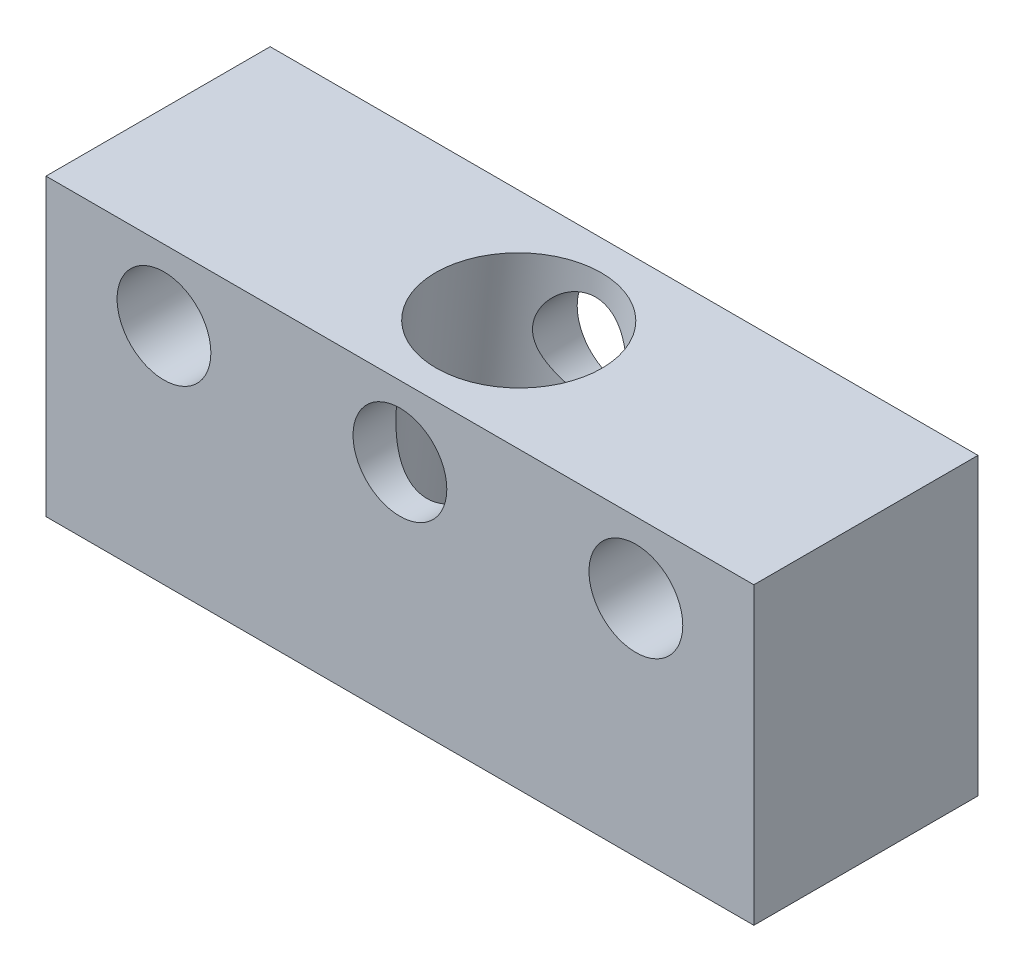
ISO-10303-21;
HEADER;
FILE_DESCRIPTION(('STEP AP214'),'2;1');
FILE_NAME('part.step','',(''),(''),'','','');
FILE_SCHEMA(('AUTOMOTIVE_DESIGN { 1 0 10303 214 1 1 1 1 }'));
ENDSEC;
DATA;
#1=APPLICATION_CONTEXT('core data for automotive mechanical design processes');
#2=APPLICATION_PROTOCOL_DEFINITION('international standard','automotive_design',2000,#1);
#3=PRODUCT_CONTEXT('',#1,'mechanical');
#4=PRODUCT('Part','Part','',(#3));
#5=PRODUCT_RELATED_PRODUCT_CATEGORY('part','',(#4));
#6=PRODUCT_DEFINITION_FORMATION('','',#4);
#7=PRODUCT_DEFINITION_CONTEXT('part definition',#1,'design');
#8=PRODUCT_DEFINITION('design','',#6,#7);
#9=PRODUCT_DEFINITION_SHAPE('','',#8);
#10=(LENGTH_UNIT() NAMED_UNIT(*) SI_UNIT(.MILLI.,.METRE.));
#11=(NAMED_UNIT(*) PLANE_ANGLE_UNIT() SI_UNIT($,.RADIAN.));
#12=(NAMED_UNIT(*) SI_UNIT($,.STERADIAN.) SOLID_ANGLE_UNIT());
#13=UNCERTAINTY_MEASURE_WITH_UNIT(LENGTH_MEASURE(1.E-05),#10,'distance_accuracy_value','');
#14=(GEOMETRIC_REPRESENTATION_CONTEXT(3) GLOBAL_UNCERTAINTY_ASSIGNED_CONTEXT((#13)) GLOBAL_UNIT_ASSIGNED_CONTEXT((#10,
#11,#12)) REPRESENTATION_CONTEXT('',''));
#15=CARTESIAN_POINT('',(0.,0.,0.));
#16=DIRECTION('',(0.,0.,1.));
#17=DIRECTION('',(1.,0.,0.));
#18=AXIS2_PLACEMENT_3D('',#15,#16,#17);
#19=CARTESIAN_POINT('',(30.,-19.,19.));
#20=DIRECTION('',(0.,-1.,0.));
#21=DIRECTION('',(0.,0.,-1.));
#22=AXIS2_PLACEMENT_3D('',#19,#20,#21);
#23=PLANE('',#22);
#24=DIRECTION('',(0.,0.,-1.));
#25=VECTOR('',#24,1.);
#26=CARTESIAN_POINT('',(30.,-19.,19.));
#27=LINE('',#26,#25);
#28=CARTESIAN_POINT('',(30.,-19.,19.));
#29=VERTEX_POINT('',#28);
#30=CARTESIAN_POINT('',(30.,-19.,0.));
#31=VERTEX_POINT('',#30);
#32=EDGE_CURVE('E49',#29,#31,#27,.T.);
#33=ORIENTED_EDGE('',*,*,#32,.F.);
#34=DIRECTION('',(-1.,0.,0.));
#35=VECTOR('',#34,1.);
#36=CARTESIAN_POINT('',(30.,-19.,19.));
#37=LINE('',#36,#35);
#38=CARTESIAN_POINT('',(-30.,-19.,19.));
#39=VERTEX_POINT('',#38);
#40=EDGE_CURVE('E90',#29,#39,#37,.T.);
#41=ORIENTED_EDGE('',*,*,#40,.T.);
#42=DIRECTION('',(0.,0.,-1.));
#43=VECTOR('',#42,1.);
#44=CARTESIAN_POINT('',(-30.,-19.,19.));
#45=LINE('',#44,#43);
#46=CARTESIAN_POINT('',(-30.,-19.,0.));
#47=VERTEX_POINT('',#46);
#48=EDGE_CURVE('E11',#39,#47,#45,.T.);
#49=ORIENTED_EDGE('',*,*,#48,.T.);
#50=DIRECTION('',(-1.,0.,0.));
#51=VECTOR('',#50,1.);
#52=CARTESIAN_POINT('',(30.,-19.,0.));
#53=LINE('',#52,#51);
#54=EDGE_CURVE('E87',#31,#47,#53,.T.);
#55=ORIENTED_EDGE('',*,*,#54,.F.);
#56=EDGE_LOOP('',(#33,#41,#49,#55));
#57=FACE_BOUND('',#56,.T.);
#58=CARTESIAN_POINT('',(-1.99698047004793,-19.,9.5593296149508));
#59=DIRECTION('',(0.,-1.,0.));
#60=DIRECTION('',(1.,0.,0.));
#61=AXIS2_PLACEMENT_3D('',#58,#59,#60);
#62=ELLIPSE('',#61,7.03855795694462,7.);
#63=CARTESIAN_POINT('',(5.04157748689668,-19.,9.5593296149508));
#64=VERTEX_POINT('',#63);
#65=EDGE_CURVE('E196',#64,#64,#62,.F.);
#66=ORIENTED_EDGE('',*,*,#65,.T.);
#67=EDGE_LOOP('',(#66));
#68=FACE_BOUND('',#67,.T.);
#69=ADVANCED_FACE('F36',(#57,#68),#23,.T.);
#70=CARTESIAN_POINT('',(-30.,6.,19.));
#71=DIRECTION('',(0.,1.,0.));
#72=DIRECTION('',(0.,0.,1.));
#73=AXIS2_PLACEMENT_3D('',#70,#71,#72);
#74=PLANE('',#73);
#75=DIRECTION('',(1.,0.,0.));
#76=VECTOR('',#75,1.);
#77=CARTESIAN_POINT('',(-30.,6.,19.));
#78=LINE('',#77,#76);
#79=CARTESIAN_POINT('',(-30.,6.,19.));
#80=VERTEX_POINT('',#79);
#81=CARTESIAN_POINT('',(30.,6.00000000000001,19.));
#82=VERTEX_POINT('',#81);
#83=EDGE_CURVE('E114',#80,#82,#78,.T.);
#84=ORIENTED_EDGE('',*,*,#83,.T.);
#85=DIRECTION('',(0.,0.,-1.));
#86=VECTOR('',#85,1.);
#87=CARTESIAN_POINT('',(30.,6.00000000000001,19.));
#88=LINE('',#87,#86);
#89=CARTESIAN_POINT('',(30.,6.00000000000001,0.));
#90=VERTEX_POINT('',#89);
#91=EDGE_CURVE('E65',#82,#90,#88,.T.);
#92=ORIENTED_EDGE('',*,*,#91,.T.);
#93=DIRECTION('',(1.,0.,0.));
#94=VECTOR('',#93,1.);
#95=CARTESIAN_POINT('',(-30.,6.,0.));
#96=LINE('',#95,#94);
#97=CARTESIAN_POINT('',(-30.,6.,0.));
#98=VERTEX_POINT('',#97);
#99=EDGE_CURVE('E104',#98,#90,#96,.T.);
#100=ORIENTED_EDGE('',*,*,#99,.F.);
#101=DIRECTION('',(0.,0.,-1.));
#102=VECTOR('',#101,1.);
#103=CARTESIAN_POINT('',(-30.,6.,19.));
#104=LINE('',#103,#102);
#105=EDGE_CURVE('E57',#80,#98,#104,.T.);
#106=ORIENTED_EDGE('',*,*,#105,.F.);
#107=EDGE_LOOP('',(#84,#92,#100,#106));
#108=FACE_BOUND('',#107,.T.);
#109=CARTESIAN_POINT('',(0.630625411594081,6.00000000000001,9.5593296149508));
#110=DIRECTION('',(0.,1.,0.));
#111=DIRECTION('',(1.,0.,0.));
#112=AXIS2_PLACEMENT_3D('',#109,#110,#111);
#113=ELLIPSE('',#112,7.03855795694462,7.);
#114=CARTESIAN_POINT('',(7.6691833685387,6.00000000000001,9.5593296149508));
#115=VERTEX_POINT('',#114);
#116=EDGE_CURVE('E198',#115,#115,#113,.F.);
#117=ORIENTED_EDGE('',*,*,#116,.T.);
#118=EDGE_LOOP('',(#117));
#119=FACE_BOUND('',#118,.T.);
#120=ADVANCED_FACE('F144',(#108,#119),#74,.T.);
#121=CARTESIAN_POINT('',(0.,0.,19.));
#122=DIRECTION('',(0.,0.,-1.));
#123=DIRECTION('',(-1.,0.,0.));
#124=AXIS2_PLACEMENT_3D('',#121,#122,#123);
#125=CYLINDRICAL_SURFACE('',#124,3.975);
#126=CARTESIAN_POINT('',(0.,0.,19.));
#127=DIRECTION('',(0.,0.,1.));
#128=DIRECTION('',(1.,0.,0.));
#129=AXIS2_PLACEMENT_3D('',#126,#127,#128);
#130=CIRCLE('',#129,3.975);
#131=CARTESIAN_POINT('',(3.975,0.,19.));
#132=VERTEX_POINT('',#131);
#133=EDGE_CURVE('E175',#132,#132,#130,.T.);
#134=ORIENTED_EDGE('',*,*,#133,.T.);
#135=EDGE_LOOP('',(#134));
#136=FACE_BOUND('',#135,.T.);
#137=CARTESIAN_POINT('',(-3.975,0.,15.3361813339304));
#138=CARTESIAN_POINT('',(-3.97500047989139,0.0970481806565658,15.3292387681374));
#139=CARTESIAN_POINT('',(-3.97144172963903,0.194261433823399,15.324672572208));
#140=CARTESIAN_POINT('',(-3.9571848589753,0.388302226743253,15.3204647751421));
#141=CARTESIAN_POINT('',(-3.94648471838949,0.485129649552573,15.3208245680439));
#142=CARTESIAN_POINT('',(-3.91803147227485,0.677576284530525,15.3264615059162));
#143=CARTESIAN_POINT('',(-3.9002800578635,0.773195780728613,15.3317374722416));
#144=CARTESIAN_POINT('',(-3.85792428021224,0.962536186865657,15.346991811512));
#145=CARTESIAN_POINT('',(-3.83331709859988,1.05625629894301,15.3569721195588));
#146=CARTESIAN_POINT('',(-3.74985033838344,1.3327026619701,15.3933485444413));
#147=CARTESIAN_POINT('',(-3.68119154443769,1.51173557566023,15.4262161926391));
#148=CARTESIAN_POINT('',(-3.52041410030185,1.85566346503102,15.5050484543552));
#149=CARTESIAN_POINT('',(-3.4282811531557,2.02054974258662,15.5510210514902));
#150=CARTESIAN_POINT('',(-3.21549166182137,2.34556654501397,15.6549592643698));
#151=CARTESIAN_POINT('',(-3.09322683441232,2.50443819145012,15.7135613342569));
#152=CARTESIAN_POINT('',(-2.82719328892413,2.80132524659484,15.8346201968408));
#153=CARTESIAN_POINT('',(-2.68341173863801,2.93932811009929,15.8970792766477));
#154=CARTESIAN_POINT('',(-2.35274556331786,3.21213701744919,16.0301805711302));
#155=CARTESIAN_POINT('',(-2.162632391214,3.3432025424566,16.1006076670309));
#156=CARTESIAN_POINT('',(-1.86100008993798,3.51435873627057,16.1993437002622));
#157=CARTESIAN_POINT('',(-1.75764089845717,3.56719607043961,16.2311230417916));
#158=CARTESIAN_POINT('',(-1.54595086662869,3.66390214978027,16.2915464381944));
#159=CARTESIAN_POINT('',(-1.43762268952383,3.70777563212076,16.320192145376));
#160=CARTESIAN_POINT('',(-1.21875464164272,3.78529878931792,16.3730364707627));
#161=CARTESIAN_POINT('',(-1.10829588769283,3.81912686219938,16.3973092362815));
#162=CARTESIAN_POINT('',(-0.884056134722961,3.87717312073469,16.4413590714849));
#163=CARTESIAN_POINT('',(-0.7702769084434,3.90139633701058,16.4611384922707));
#164=CARTESIAN_POINT('',(-0.540361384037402,3.93982342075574,16.4956019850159));
#165=CARTESIAN_POINT('',(-0.424226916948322,3.95403478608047,16.5102898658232));
#166=CARTESIAN_POINT('',(-0.190596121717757,3.97215551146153,16.5341186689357));
#167=CARTESIAN_POINT('',(-0.0731000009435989,3.97606642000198,16.5432604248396));
#168=CARTESIAN_POINT('',(0.147196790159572,3.97360210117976,16.554910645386));
#169=CARTESIAN_POINT('',(0.249976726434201,3.96846518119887,16.5581117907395));
#170=CARTESIAN_POINT('',(0.454904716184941,3.95022424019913,16.5599740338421));
#171=CARTESIAN_POINT('',(0.557052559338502,3.93711769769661,16.5586336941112));
#172=CARTESIAN_POINT('',(0.759817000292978,3.90305797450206,16.5514432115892));
#173=CARTESIAN_POINT('',(0.860434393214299,3.88210902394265,16.5455954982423));
#174=CARTESIAN_POINT('',(1.05943473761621,3.83259139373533,16.5295500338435));
#175=CARTESIAN_POINT('',(1.15781682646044,3.80401982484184,16.5193506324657));
#176=CARTESIAN_POINT('',(1.43884001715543,3.71051469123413,16.4837968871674));
#177=CARTESIAN_POINT('',(1.61772233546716,3.63598247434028,16.4530612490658));
#178=CARTESIAN_POINT('',(1.96066934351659,3.46314514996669,16.3793153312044));
#179=CARTESIAN_POINT('',(2.12473153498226,3.36483604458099,16.336302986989));
#180=CARTESIAN_POINT('',(2.44760953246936,3.13873345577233,16.2375685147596));
#181=CARTESIAN_POINT('',(2.60500307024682,3.00923151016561,16.1811138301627));
#182=CARTESIAN_POINT('',(2.89722748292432,2.72905735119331,16.0623670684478));
#183=CARTESIAN_POINT('',(3.03203790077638,2.57836616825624,16.0000697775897));
#184=CARTESIAN_POINT('',(3.29239197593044,2.23876037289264,15.8669059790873));
#185=CARTESIAN_POINT('',(3.41473502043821,2.04742354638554,15.7959313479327));
#186=CARTESIAN_POINT('',(3.62585452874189,1.64481139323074,15.6607798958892));
#187=CARTESIAN_POINT('',(3.71464607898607,1.43354508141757,15.5966000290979));
#188=CARTESIAN_POINT('',(3.84407946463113,1.03009538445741,15.4926743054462));
#189=CARTESIAN_POINT('',(3.89014295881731,0.840244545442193,15.4506638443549));
#190=CARTESIAN_POINT('',(3.95394493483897,0.453117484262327,15.3826703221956));
#191=CARTESIAN_POINT('',(3.97171862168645,0.255850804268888,15.3566673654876));
#192=CARTESIAN_POINT('',(3.97746278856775,-0.141765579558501,15.3244027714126));
#193=CARTESIAN_POINT('',(3.96529178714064,-0.342125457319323,15.3182351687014));
#194=CARTESIAN_POINT('',(3.91095152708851,-0.738287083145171,15.326941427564));
#195=CARTESIAN_POINT('',(3.86877652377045,-0.934087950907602,15.3418193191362));
#196=CARTESIAN_POINT('',(3.76054059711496,-1.30113345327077,15.3884447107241));
#197=CARTESIAN_POINT('',(3.6964237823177,-1.4731304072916,15.4188968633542));
#198=CARTESIAN_POINT('',(3.54647456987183,-1.80450951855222,15.4921533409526));
#199=CARTESIAN_POINT('',(3.46063401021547,-1.96388690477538,15.5349623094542));
#200=CARTESIAN_POINT('',(3.25860174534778,-2.2852064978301,15.6340905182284));
#201=CARTESIAN_POINT('',(3.14006358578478,-2.44536352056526,15.6913942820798));
#202=CARTESIAN_POINT('',(2.88144349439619,-2.74539293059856,15.8105077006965));
#203=CARTESIAN_POINT('',(2.74134534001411,-2.88524988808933,15.872320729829));
#204=CARTESIAN_POINT('',(2.41846905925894,-3.16287065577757,16.0048544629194));
#205=CARTESIAN_POINT('',(2.23244175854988,-3.29692963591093,16.0754662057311));
#206=CARTESIAN_POINT('',(1.83769503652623,-3.5321615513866,16.2085435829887));
#207=CARTESIAN_POINT('',(1.62897337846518,-3.63333124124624,16.2710084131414));
#208=CARTESIAN_POINT('',(1.30351741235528,-3.75697457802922,16.353330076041));
#209=CARTESIAN_POINT('',(1.19334542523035,-3.79343089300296,16.378810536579));
#210=CARTESIAN_POINT('',(0.96939479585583,-3.85673608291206,16.4253972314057));
#211=CARTESIAN_POINT('',(0.855618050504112,-3.88358992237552,16.4465057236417));
#212=CARTESIAN_POINT('',(0.625434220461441,-3.92723488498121,16.4836951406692));
#213=CARTESIAN_POINT('',(0.509029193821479,-3.94403361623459,16.4997798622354));
#214=CARTESIAN_POINT('',(0.274564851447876,-3.96725454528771,16.5264291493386));
#215=CARTESIAN_POINT('',(0.15650579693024,-3.97367836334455,16.5369945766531));
#216=CARTESIAN_POINT('',(-0.065218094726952,-3.97581130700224,16.551296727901));
#217=CARTESIAN_POINT('',(-0.16882837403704,-3.97276488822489,16.5557244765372));
#218=CARTESIAN_POINT('',(-0.375624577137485,-3.9585698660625,16.5599807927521));
#219=CARTESIAN_POINT('',(-0.478810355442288,-3.9474186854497,16.5598078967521));
#220=CARTESIAN_POINT('',(-0.683829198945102,-3.91710731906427,16.5548617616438));
#221=CARTESIAN_POINT('',(-0.785663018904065,-3.89795181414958,16.5500912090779));
#222=CARTESIAN_POINT('',(-0.987248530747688,-3.85184074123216,16.5360857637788));
#223=CARTESIAN_POINT('',(-1.08699942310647,-3.82488223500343,16.5268491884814));
#224=CARTESIAN_POINT('',(-1.37054842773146,-3.73627840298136,16.49407987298));
#225=CARTESIAN_POINT('',(-1.5508301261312,-3.66501761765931,16.4651243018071));
#226=CARTESIAN_POINT('',(-1.89703898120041,-3.49841023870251,16.3945877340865));
#227=CARTESIAN_POINT('',(-2.06296369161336,-3.40305955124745,16.3530045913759));
#228=CARTESIAN_POINT('',(-2.38905080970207,-3.18346095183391,16.2570938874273));
#229=CARTESIAN_POINT('',(-2.54793474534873,-3.05762498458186,16.2020635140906));
#230=CARTESIAN_POINT('',(-2.84367750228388,-2.78472192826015,16.0856633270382));
#231=CARTESIAN_POINT('',(-2.98051984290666,-2.63763910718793,16.0242888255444));
#232=CARTESIAN_POINT('',(-3.24589213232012,-2.3055300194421,15.8923355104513));
#233=CARTESIAN_POINT('',(-3.37127244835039,-2.11805981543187,15.8215611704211));
#234=CARTESIAN_POINT('',(-3.58935965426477,-1.72278653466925,15.6856514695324));
#235=CARTESIAN_POINT('',(-3.68205766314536,-1.51497795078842,15.6205176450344));
#236=CARTESIAN_POINT('',(-3.79222517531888,-1.19645151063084,15.5348424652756));
#237=CARTESIAN_POINT('',(-3.82366829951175,-1.09188136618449,15.5088117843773));
#238=CARTESIAN_POINT('',(-3.87799486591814,-0.87963695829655,15.4608784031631));
#239=CARTESIAN_POINT('',(-3.9008829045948,-0.771964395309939,15.4389734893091));
#240=CARTESIAN_POINT('',(-3.93769819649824,-0.554363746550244,15.4001946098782));
#241=CARTESIAN_POINT('',(-3.95163821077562,-0.444439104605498,15.3833134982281));
#242=CARTESIAN_POINT('',(-3.97028801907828,-0.223082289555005,15.3553009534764));
#243=CARTESIAN_POINT('',(-3.97499944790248,-0.111650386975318,15.3441685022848));
#244=CARTESIAN_POINT('',(-3.975,0.,15.3361813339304));
#245=B_SPLINE_CURVE_WITH_KNOTS('',3,(#137,#138,#139,#140,#141,#142,#143,#144,#145,#146,#147,
#148,#149,#150,#151,#152,#153,#154,#155,#156,#157,#158,#159,#160,#161,#162,#163,#164,#165,#166,
#167,#168,#169,#170,#171,#172,#173,#174,#175,#176,#177,#178,#179,#180,#181,#182,#183,#184,#185,
#186,#187,#188,#189,#190,#191,#192,#193,#194,#195,#196,#197,#198,#199,#200,#201,#202,#203,#204,
#205,#206,#207,#208,#209,#210,#211,#212,#213,#214,#215,#216,#217,#218,#219,#220,#221,#222,#223,
#224,#225,#226,#227,#228,#229,#230,#231,#232,#233,#234,#235,#236,#237,#238,#239,#240,#241,#242,
#243,#244),.UNSPECIFIED.,.T.,.F.,(4,2,2,2,2,2,2,2,2,2,2,2,2,2,2,2,2,2,2,2,2,2,2,2,2,2,2,2,2,2,2,
2,2,2,2,2,2,2,2,2,2,2,2,2,2,2,2,2,2,2,2,2,2,4),(0.,0.291781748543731,0.583646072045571,
0.875440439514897,1.16735493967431,1.74812667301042,2.3292529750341,2.95346298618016,
3.5780467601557,4.29847876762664,4.65915610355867,5.01964233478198,5.37328000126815,
5.72673220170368,6.07991942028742,6.4330535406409,6.74152779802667,7.05009970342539,
7.35850540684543,7.66702817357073,8.25289669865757,8.83886380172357,9.47081863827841,
10.103342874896,10.8139839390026,11.524305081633,12.1213064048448,12.7175642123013,
13.3166445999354,13.9158397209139,14.471779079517,15.0279276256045,15.6475808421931,
16.2677026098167,16.9842202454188,17.7008085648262,18.056810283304,18.4126276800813,
18.7681755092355,19.1236678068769,19.434509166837,19.7454494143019,20.056208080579,
20.3670839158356,20.952312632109,21.5376408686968,22.1651804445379,22.7931870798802,
23.4992864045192,24.2055774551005,24.5419827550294,24.8782070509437,25.2139507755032,
25.5496350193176),.UNSPECIFIED.);
#246=CARTESIAN_POINT('',(-3.975,0.,15.3361813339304));
#247=VERTEX_POINT('',#246);
#248=EDGE_CURVE('E39',#247,#247,#245,.T.);
#249=ORIENTED_EDGE('',*,*,#248,.T.);
#250=EDGE_LOOP('',(#249));
#251=FACE_BOUND('',#250,.T.);
#252=ADVANCED_FACE('F123',(#136,#251),#125,.F.);
#253=CARTESIAN_POINT('',(0.,0.,0.));
#254=DIRECTION('',(0.,0.,1.));
#255=DIRECTION('',(1.,0.,0.));
#256=AXIS2_PLACEMENT_3D('',#253,#254,#255);
#257=CIRCLE('',#256,3.975);
#258=CARTESIAN_POINT('',(3.975,0.,0.));
#259=VERTEX_POINT('',#258);
#260=EDGE_CURVE('E173',#259,#259,#257,.T.);
#261=ORIENTED_EDGE('',*,*,#260,.F.);
#262=EDGE_LOOP('',(#261));
#263=FACE_BOUND('',#262,.T.);
#264=CARTESIAN_POINT('',(-3.975,0.,3.78247789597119));
#265=CARTESIAN_POINT('',(-3.97500215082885,-0.106197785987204,3.77488497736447));
#266=CARTESIAN_POINT('',(-3.97073806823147,-0.212163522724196,3.76444206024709));
#267=CARTESIAN_POINT('',(-3.95386487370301,-0.422791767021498,3.73834076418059));
#268=CARTESIAN_POINT('',(-3.94125310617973,-0.527453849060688,3.72268072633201));
#269=CARTESIAN_POINT('',(-3.89121498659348,-0.838532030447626,3.66874817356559));
#270=CARTESIAN_POINT('',(-3.84158635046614,-1.04190493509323,3.62353416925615));
#271=CARTESIAN_POINT('',(-3.71305739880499,-1.43395008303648,3.52128720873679));
#272=CARTESIAN_POINT('',(-3.63437159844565,-1.62271809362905,3.4643421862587));
#273=CARTESIAN_POINT('',(-3.45011708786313,-1.98456898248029,3.34458208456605));
#274=CARTESIAN_POINT('',(-3.34454626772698,-2.15765062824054,3.28176654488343));
#275=CARTESIAN_POINT('',(-3.09460589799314,-2.50500828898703,3.14849785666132));
#276=CARTESIAN_POINT('',(-2.94714016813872,-2.67704945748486,3.07801193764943));
#277=CARTESIAN_POINT('',(-2.62332198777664,-2.99502699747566,2.94382839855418));
#278=CARTESIAN_POINT('',(-2.44696238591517,-3.1409568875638,2.88013246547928));
#279=CARTESIAN_POINT('',(-2.16245402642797,-3.33735729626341,2.79434862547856));
#280=CARTESIAN_POINT('',(-2.06361560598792,-3.39938711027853,2.76724410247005));
#281=CARTESIAN_POINT('',(-1.86007090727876,-3.51488683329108,2.71722743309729));
#282=CARTESIAN_POINT('',(-1.75536758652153,-3.56836100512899,2.69431319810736));
#283=CARTESIAN_POINT('',(-1.54091192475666,-3.6660734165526,2.65338288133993));
#284=CARTESIAN_POINT('',(-1.43116335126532,-3.71031841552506,2.63536321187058));
#285=CARTESIAN_POINT('',(-1.20747713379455,-3.78901998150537,2.60477565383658));
#286=CARTESIAN_POINT('',(-1.0935401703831,-3.82347813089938,2.59220688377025));
#287=CARTESIAN_POINT('',(-0.876756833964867,-3.8785113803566,2.57412247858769));
#288=CARTESIAN_POINT('',(-0.77426589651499,-3.90027144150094,2.56793043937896));
#289=CARTESIAN_POINT('',(-0.56771855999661,-3.93564444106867,2.56022482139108));
#290=CARTESIAN_POINT('',(-0.463662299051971,-3.94925809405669,2.55871083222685));
#291=CARTESIAN_POINT('',(-0.25485993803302,-3.96820524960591,2.56040455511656));
#292=CARTESIAN_POINT('',(-0.15011402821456,-3.97354094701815,2.56361101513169));
#293=CARTESIAN_POINT('',(0.0591995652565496,-3.97593919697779,2.57464712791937));
#294=CARTESIAN_POINT('',(0.163767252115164,-3.97300189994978,2.58247669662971));
#295=CARTESIAN_POINT('',(0.461617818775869,-3.95286569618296,2.6112407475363));
#296=CARTESIAN_POINT('',(0.653799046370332,-3.9255683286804,2.6376544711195));
#297=CARTESIAN_POINT('',(1.02986775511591,-3.84410129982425,2.70360134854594));
#298=CARTESIAN_POINT('',(1.21375382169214,-3.78992707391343,2.74313673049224));
#299=CARTESIAN_POINT('',(1.58088709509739,-3.65269492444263,2.83499985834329));
#300=CARTESIAN_POINT('',(1.76337407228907,-3.56804152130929,2.8879733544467));
#301=CARTESIAN_POINT('',(2.11196599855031,-3.37344530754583,3.00093124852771));
#302=CARTESIAN_POINT('',(2.27806126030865,-3.26348766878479,3.0609197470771));
#303=CARTESIAN_POINT('',(2.61108323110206,-3.00543445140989,3.19088290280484));
#304=CARTESIAN_POINT('',(2.77553082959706,-2.85429292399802,3.2611700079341));
#305=CARTESIAN_POINT('',(3.07786634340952,-2.52532057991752,3.3975952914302));
#306=CARTESIAN_POINT('',(3.21573128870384,-2.34746691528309,3.46372984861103));
#307=CARTESIAN_POINT('',(3.40192520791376,-2.05944183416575,3.55481734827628));
#308=CARTESIAN_POINT('',(3.46145416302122,-1.95779218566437,3.58429318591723));
#309=CARTESIAN_POINT('',(3.57165378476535,-1.74867413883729,3.63874027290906));
#310=CARTESIAN_POINT('',(3.62232938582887,-1.64120902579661,3.66371403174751));
#311=CARTESIAN_POINT('',(3.71410168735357,-1.42135185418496,3.70798954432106));
#312=CARTESIAN_POINT('',(3.75521455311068,-1.3089684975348,3.72730088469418));
#313=CARTESIAN_POINT('',(3.8273243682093,-1.08009062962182,3.75930806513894));
#314=CARTESIAN_POINT('',(3.85832396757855,-0.963597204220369,3.77200563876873));
#315=CARTESIAN_POINT('',(3.90583866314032,-0.745379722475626,3.78872137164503));
#316=CARTESIAN_POINT('',(3.92382633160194,-0.644051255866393,3.79375329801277));
#317=CARTESIAN_POINT('',(3.95189123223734,-0.440187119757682,3.79830379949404));
#318=CARTESIAN_POINT('',(3.96196932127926,-0.337651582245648,3.79782297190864));
#319=CARTESIAN_POINT('',(3.97412970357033,-0.132276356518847,3.7913659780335));
#320=CARTESIAN_POINT('',(3.97621179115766,-0.029436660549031,3.78538967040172));
#321=CARTESIAN_POINT('',(3.97244391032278,0.175630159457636,3.76821137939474));
#322=CARTESIAN_POINT('',(3.96659400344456,0.277857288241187,3.75700943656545));
#323=CARTESIAN_POINT('',(3.93926936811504,0.562677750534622,3.71885986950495));
#324=CARTESIAN_POINT('',(3.90901212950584,0.743782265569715,3.68649442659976));
#325=CARTESIAN_POINT('',(3.82479558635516,1.09760804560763,3.60991680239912));
#326=CARTESIAN_POINT('',(3.77082905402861,1.27032673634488,3.56570101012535));
#327=CARTESIAN_POINT('',(3.63287540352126,1.62590408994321,3.46367465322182));
#328=CARTESIAN_POINT('',(3.54598747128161,1.80734850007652,3.40485693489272));
#329=CARTESIAN_POINT('',(3.34665231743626,2.15421897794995,3.28334399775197));
#330=CARTESIAN_POINT('',(3.2341846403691,2.31963207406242,3.22064570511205));
#331=CARTESIAN_POINT('',(2.96667856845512,2.65557207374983,3.08732867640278));
#332=CARTESIAN_POINT('',(2.80779093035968,2.82317338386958,3.01692546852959));
#333=CARTESIAN_POINT('',(2.54808056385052,3.05308482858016,2.91825706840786));
#334=CARTESIAN_POINT('',(2.45788555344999,3.1261783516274,2.88650637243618));
#335=CARTESIAN_POINT('',(2.27077285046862,3.26461891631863,2.82614969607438));
#336=CARTESIAN_POINT('',(2.17385875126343,3.32997004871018,2.79754205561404));
#337=CARTESIAN_POINT('',(1.97578342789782,3.45110470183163,2.74479097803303));
#338=CARTESIAN_POINT('',(1.87474057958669,3.50704880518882,2.72057190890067));
#339=CARTESIAN_POINT('',(1.66741866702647,3.61022650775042,2.67663379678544));
#340=CARTESIAN_POINT('',(1.56114237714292,3.65746466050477,2.65691240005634));
#341=CARTESIAN_POINT('',(1.34421266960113,3.74263074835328,2.62256735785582));
#342=CARTESIAN_POINT('',(1.23356255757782,3.78056556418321,2.60793994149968));
#343=CARTESIAN_POINT('',(1.00880133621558,3.84664258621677,2.58423272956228));
#344=CARTESIAN_POINT('',(0.894690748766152,3.87478626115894,2.57515210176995));
#345=CARTESIAN_POINT('',(0.678718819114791,3.9179733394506,2.5636151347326));
#346=CARTESIAN_POINT('',(0.577133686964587,3.93422346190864,2.56046620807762));
#347=CARTESIAN_POINT('',(0.372934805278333,3.95880319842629,2.55870575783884));
#348=CARTESIAN_POINT('',(0.270320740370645,3.96713030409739,2.56009567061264));
#349=CARTESIAN_POINT('',(0.0649675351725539,3.97579622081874,2.56738135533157));
#350=CARTESIAN_POINT('',(-0.0377715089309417,3.97613929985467,2.57327471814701));
#351=CARTESIAN_POINT('',(-0.242640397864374,3.96891382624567,2.58940656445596));
#352=CARTESIAN_POINT('',(-0.344769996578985,3.96134226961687,2.59964669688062));
#353=CARTESIAN_POINT('',(-0.639031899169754,3.92808083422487,2.63531910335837));
#354=CARTESIAN_POINT('',(-0.829472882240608,3.89221892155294,2.66613087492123));
#355=CARTESIAN_POINT('',(-1.20078053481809,3.79416976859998,2.74001384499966));
#356=CARTESIAN_POINT('',(-1.38164563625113,3.7319782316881,2.78308704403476));
#357=CARTESIAN_POINT('',(-1.74440026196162,3.57764265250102,2.88194178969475));
#358=CARTESIAN_POINT('',(-1.92524877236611,3.48352550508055,2.93845700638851));
#359=CARTESIAN_POINT('',(-2.26925353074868,3.26989218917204,3.05730262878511));
#360=CARTESIAN_POINT('',(-2.43239360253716,3.15035308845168,3.11963825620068));
#361=CARTESIAN_POINT('',(-2.75750910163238,2.87194113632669,3.25284598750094));
#362=CARTESIAN_POINT('',(-2.91685693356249,2.71003487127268,3.32382233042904));
#363=CARTESIAN_POINT('',(-3.20683437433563,2.3597683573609,3.45893441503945));
#364=CARTESIAN_POINT('',(-3.33747478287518,2.17141810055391,3.52307272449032));
#365=CARTESIAN_POINT('',(-3.54766458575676,1.80334575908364,3.62685258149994));
#366=CARTESIAN_POINT('',(-3.63204308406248,1.62705902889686,3.6687712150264));
#367=CARTESIAN_POINT('',(-3.73893518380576,1.35300273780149,3.71961537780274));
#368=CARTESIAN_POINT('',(-3.77127685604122,1.26008859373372,3.73455393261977));
#369=CARTESIAN_POINT('',(-3.82911147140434,1.07156259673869,3.75993392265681));
#370=CARTESIAN_POINT('',(-3.85460584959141,0.975951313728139,3.77037630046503));
#371=CARTESIAN_POINT('',(-3.90912767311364,0.735555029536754,3.79023699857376));
#372=CARTESIAN_POINT('',(-3.9338259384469,0.589505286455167,3.79667825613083));
#373=CARTESIAN_POINT('',(-3.96676182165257,0.295487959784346,3.7980732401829));
#374=CARTESIAN_POINT('',(-3.97499701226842,0.147520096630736,3.79302527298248));
#375=CARTESIAN_POINT('',(-3.975,0.,3.78247789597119));
#376=B_SPLINE_CURVE_WITH_KNOTS('',3,(#264,#265,#266,#267,#268,#269,#270,#271,#272,#273,#274,
#275,#276,#277,#278,#279,#280,#281,#282,#283,#284,#285,#286,#287,#288,#289,#290,#291,#292,#293,
#294,#295,#296,#297,#298,#299,#300,#301,#302,#303,#304,#305,#306,#307,#308,#309,#310,#311,#312,
#313,#314,#315,#316,#317,#318,#319,#320,#321,#322,#323,#324,#325,#326,#327,#328,#329,#330,#331,
#332,#333,#334,#335,#336,#337,#338,#339,#340,#341,#342,#343,#344,#345,#346,#347,#348,#349,#350,
#351,#352,#353,#354,#355,#356,#357,#358,#359,#360,#361,#362,#363,#364,#365,#366,#367,#368,#369,
#370,#371,#372,#373,#374,#375),.UNSPECIFIED.,.T.,.F.,(4,2,2,2,2,2,2,2,2,2,2,2,2,2,2,2,2,2,2,2,2,
2,2,2,2,2,2,2,2,2,2,2,2,2,2,2,2,2,2,2,2,2,2,2,2,2,2,2,2,2,2,2,2,2,2,4),(0.,0.319231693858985,
0.638564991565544,1.27763224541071,1.91207293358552,2.54656342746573,3.25537437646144,
3.96436102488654,4.32331965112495,4.68209886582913,5.04061438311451,5.39907190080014,
5.71352762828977,6.02795576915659,6.342300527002,6.65663956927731,7.24151165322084,
7.82648310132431,8.44806465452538,9.07001138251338,9.76951480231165,10.4696199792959,
10.8334590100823,11.1970946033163,11.5601109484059,11.9230320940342,12.231697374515,
12.5403292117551,12.8489689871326,13.157606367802,13.7144689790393,14.271501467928,
14.8978759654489,15.5247531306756,16.2452506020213,16.6059409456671,16.9664398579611,
17.3199673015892,17.6733093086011,18.0263891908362,18.3794160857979,18.6877911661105,
18.9962638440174,19.3045716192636,19.6129964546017,20.1989009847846,20.7849011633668,
21.4170497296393,22.0497709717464,22.7605647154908,23.4710905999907,24.0680136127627,
24.3662169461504,24.6643577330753,25.107739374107,25.5511863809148),.UNSPECIFIED.);
#377=CARTESIAN_POINT('',(-3.975,0.,3.78247789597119));
#378=VERTEX_POINT('',#377);
#379=EDGE_CURVE('E118',#378,#378,#376,.T.);
#380=ORIENTED_EDGE('',*,*,#379,.T.);
#381=EDGE_LOOP('',(#380));
#382=FACE_BOUND('',#381,.T.);
#383=ADVANCED_FACE('F152',(#263,#382),#125,.F.);
#384=CARTESIAN_POINT('',(-30.,-19.,19.));
#385=DIRECTION('',(0.,0.,-1.));
#386=DIRECTION('',(-1.,0.,0.));
#387=AXIS2_PLACEMENT_3D('',#384,#385,#386);
#388=PLANE('',#387);
#389=ORIENTED_EDGE('',*,*,#133,.F.);
#390=EDGE_LOOP('',(#389));
#391=FACE_BOUND('',#390,.T.);
#392=DIRECTION('',(0.,-1.,0.));
#393=VECTOR('',#392,1.);
#394=CARTESIAN_POINT('',(-30.,6.,19.));
#395=LINE('',#394,#393);
#396=EDGE_CURVE('E109',#80,#39,#395,.T.);
#397=ORIENTED_EDGE('',*,*,#396,.T.);
#398=ORIENTED_EDGE('',*,*,#40,.F.);
#399=DIRECTION('',(0.,1.,0.));
#400=VECTOR('',#399,1.);
#401=CARTESIAN_POINT('',(30.,-19.,19.));
#402=LINE('',#401,#400);
#403=EDGE_CURVE('E112',#29,#82,#402,.T.);
#404=ORIENTED_EDGE('',*,*,#403,.T.);
#405=ORIENTED_EDGE('',*,*,#83,.F.);
#406=EDGE_LOOP('',(#397,#398,#404,#405));
#407=FACE_BOUND('',#406,.T.);
#408=CARTESIAN_POINT('',(-20.,0.,19.));
#409=DIRECTION('',(0.,0.,1.));
#410=DIRECTION('',(1.,0.,0.));
#411=AXIS2_PLACEMENT_3D('',#408,#409,#410);
#412=CIRCLE('',#411,3.975);
#413=CARTESIAN_POINT('',(-16.025,0.,19.));
#414=VERTEX_POINT('',#413);
#415=EDGE_CURVE('E98',#414,#414,#412,.T.);
#416=ORIENTED_EDGE('',*,*,#415,.F.);
#417=EDGE_LOOP('',(#416));
#418=FACE_BOUND('',#417,.T.);
#419=CARTESIAN_POINT('',(20.,0.,19.));
#420=DIRECTION('',(0.,0.,1.));
#421=DIRECTION('',(1.,0.,0.));
#422=AXIS2_PLACEMENT_3D('',#419,#420,#421);
#423=CIRCLE('',#422,3.975);
#424=CARTESIAN_POINT('',(23.975,0.,19.));
#425=VERTEX_POINT('',#424);
#426=EDGE_CURVE('E176',#425,#425,#423,.T.);
#427=ORIENTED_EDGE('',*,*,#426,.F.);
#428=EDGE_LOOP('',(#427));
#429=FACE_BOUND('',#428,.T.);
#430=ADVANCED_FACE('F164',(#391,#407,#418,#429),#388,.F.);
#431=CARTESIAN_POINT('',(-30.,-19.,0.));
#432=DIRECTION('',(0.,0.,-1.));
#433=DIRECTION('',(-1.,0.,0.));
#434=AXIS2_PLACEMENT_3D('',#431,#432,#433);
#435=PLANE('',#434);
#436=ORIENTED_EDGE('',*,*,#260,.T.);
#437=EDGE_LOOP('',(#436));
#438=FACE_BOUND('',#437,.T.);
#439=DIRECTION('',(0.,-1.,0.));
#440=VECTOR('',#439,1.);
#441=CARTESIAN_POINT('',(-30.,6.,0.));
#442=LINE('',#441,#440);
#443=EDGE_CURVE('E94',#98,#47,#442,.T.);
#444=ORIENTED_EDGE('',*,*,#443,.F.);
#445=ORIENTED_EDGE('',*,*,#99,.T.);
#446=DIRECTION('',(0.,1.,0.));
#447=VECTOR('',#446,1.);
#448=CARTESIAN_POINT('',(30.,-19.,0.));
#449=LINE('',#448,#447);
#450=EDGE_CURVE('E102',#31,#90,#449,.T.);
#451=ORIENTED_EDGE('',*,*,#450,.F.);
#452=ORIENTED_EDGE('',*,*,#54,.T.);
#453=EDGE_LOOP('',(#444,#445,#451,#452));
#454=FACE_BOUND('',#453,.T.);
#455=CARTESIAN_POINT('',(-20.,0.,0.));
#456=DIRECTION('',(0.,0.,1.));
#457=DIRECTION('',(1.,0.,0.));
#458=AXIS2_PLACEMENT_3D('',#455,#456,#457);
#459=CIRCLE('',#458,3.975);
#460=CARTESIAN_POINT('',(-16.025,0.,0.));
#461=VERTEX_POINT('',#460);
#462=EDGE_CURVE('E179',#461,#461,#459,.T.);
#463=ORIENTED_EDGE('',*,*,#462,.T.);
#464=EDGE_LOOP('',(#463));
#465=FACE_BOUND('',#464,.T.);
#466=CARTESIAN_POINT('',(20.,0.,0.));
#467=DIRECTION('',(0.,0.,1.));
#468=DIRECTION('',(1.,0.,0.));
#469=AXIS2_PLACEMENT_3D('',#466,#467,#468);
#470=CIRCLE('',#469,3.975);
#471=CARTESIAN_POINT('',(23.975,0.,0.));
#472=VERTEX_POINT('',#471);
#473=EDGE_CURVE('E181',#472,#472,#470,.T.);
#474=ORIENTED_EDGE('',*,*,#473,.T.);
#475=EDGE_LOOP('',(#474));
#476=FACE_BOUND('',#475,.T.);
#477=ADVANCED_FACE('F100',(#438,#454,#465,#476),#435,.T.);
#478=CARTESIAN_POINT('',(-30.,6.,19.));
#479=DIRECTION('',(1.,0.,0.));
#480=DIRECTION('',(0.,0.,-1.));
#481=AXIS2_PLACEMENT_3D('',#478,#479,#480);
#482=PLANE('',#481);
#483=ORIENTED_EDGE('',*,*,#48,.F.);
#484=ORIENTED_EDGE('',*,*,#396,.F.);
#485=ORIENTED_EDGE('',*,*,#105,.T.);
#486=ORIENTED_EDGE('',*,*,#443,.T.);
#487=EDGE_LOOP('',(#483,#484,#485,#486));
#488=FACE_BOUND('',#487,.T.);
#489=ADVANCED_FACE('F95',(#488),#482,.F.);
#490=CARTESIAN_POINT('',(30.,-19.,19.));
#491=DIRECTION('',(-1.,0.,0.));
#492=DIRECTION('',(0.,0.,1.));
#493=AXIS2_PLACEMENT_3D('',#490,#491,#492);
#494=PLANE('',#493);
#495=ORIENTED_EDGE('',*,*,#91,.F.);
#496=ORIENTED_EDGE('',*,*,#403,.F.);
#497=ORIENTED_EDGE('',*,*,#32,.T.);
#498=ORIENTED_EDGE('',*,*,#450,.T.);
#499=EDGE_LOOP('',(#495,#496,#497,#498));
#500=FACE_BOUND('',#499,.T.);
#501=ADVANCED_FACE('F139',(#500),#494,.F.);
#502=CARTESIAN_POINT('',(-20.,0.,19.));
#503=DIRECTION('',(0.,0.,-1.));
#504=DIRECTION('',(-1.,0.,0.));
#505=AXIS2_PLACEMENT_3D('',#502,#503,#504);
#506=CYLINDRICAL_SURFACE('',#505,3.975);
#507=ORIENTED_EDGE('',*,*,#415,.T.);
#508=EDGE_LOOP('',(#507));
#509=FACE_BOUND('',#508,.T.);
#510=ORIENTED_EDGE('',*,*,#462,.F.);
#511=EDGE_LOOP('',(#510));
#512=FACE_BOUND('',#511,.T.);
#513=ADVANCED_FACE('F134',(#509,#512),#506,.F.);
#514=CARTESIAN_POINT('',(20.,0.,19.));
#515=DIRECTION('',(0.,0.,-1.));
#516=DIRECTION('',(-1.,0.,0.));
#517=AXIS2_PLACEMENT_3D('',#514,#515,#516);
#518=CYLINDRICAL_SURFACE('',#517,3.975);
#519=ORIENTED_EDGE('',*,*,#426,.T.);
#520=EDGE_LOOP('',(#519));
#521=FACE_BOUND('',#520,.T.);
#522=ORIENTED_EDGE('',*,*,#473,.F.);
#523=EDGE_LOOP('',(#522));
#524=FACE_BOUND('',#523,.T.);
#525=ADVANCED_FACE('F130',(#521,#524),#518,.F.);
#526=CARTESIAN_POINT('',(0.951521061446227,9.05311816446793,9.5593296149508));
#527=DIRECTION('',(0.104528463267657,0.994521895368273,0.));
#528=DIRECTION('',(-0.994521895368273,0.104528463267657,0.));
#529=AXIS2_PLACEMENT_3D('',#526,#527,#528);
#530=CYLINDRICAL_SURFACE('',#529,7.);
#531=ORIENTED_EDGE('',*,*,#65,.F.);
#532=EDGE_LOOP('',(#531));
#533=FACE_BOUND('',#532,.T.);
#534=ORIENTED_EDGE('',*,*,#116,.F.);
#535=EDGE_LOOP('',(#534));
#536=FACE_BOUND('',#535,.T.);
#537=ORIENTED_EDGE('',*,*,#248,.F.);
#538=EDGE_LOOP('',(#537));
#539=FACE_BOUND('',#538,.T.);
#540=ORIENTED_EDGE('',*,*,#379,.F.);
#541=EDGE_LOOP('',(#540));
#542=FACE_BOUND('',#541,.T.);
#543=ADVANCED_FACE('F127',(#533,#536,#539,#542),#530,.F.);
#544=CLOSED_SHELL('',(#69,#120,#252,#383,#430,#477,#489,#501,#513,#525,#543));
#545=MANIFOLD_SOLID_BREP('B2',#544);
#546=ADVANCED_BREP_SHAPE_REPRESENTATION('',(#18,#545),#14);
#547=SHAPE_DEFINITION_REPRESENTATION(#9,#546);
ENDSEC;
END-ISO-10303-21;
